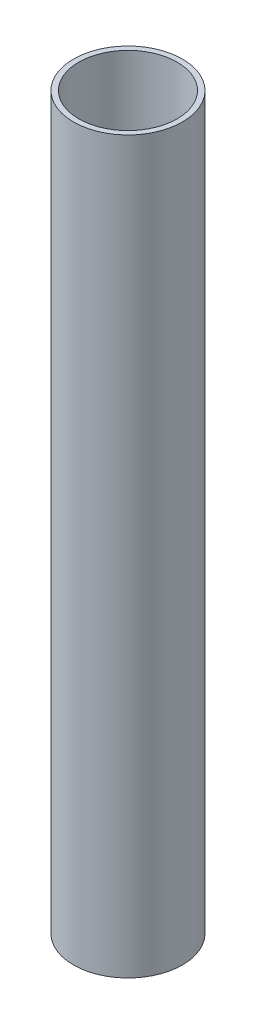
from build123d import *

# Parameters (mm, degrees)
SKETCH1_R           = 16.1163
SKETCH1_R_2         = 14.5415
EXTRUDE_THIN1_DEPTH = 215.9


with BuildPart() as part:
    # Sketch1 → Extrude-Thin1 (new body)
    with BuildSketch(Plane(origin=(0, 0, 0), x_dir=(1, 0, 0), z_dir=(0, 1, 0))):
        Circle(SKETCH1_R)
        Circle(SKETCH1_R_2, mode=Mode.SUBTRACT)
    extrude(amount=EXTRUDE_THIN1_DEPTH)


solid = part.part
